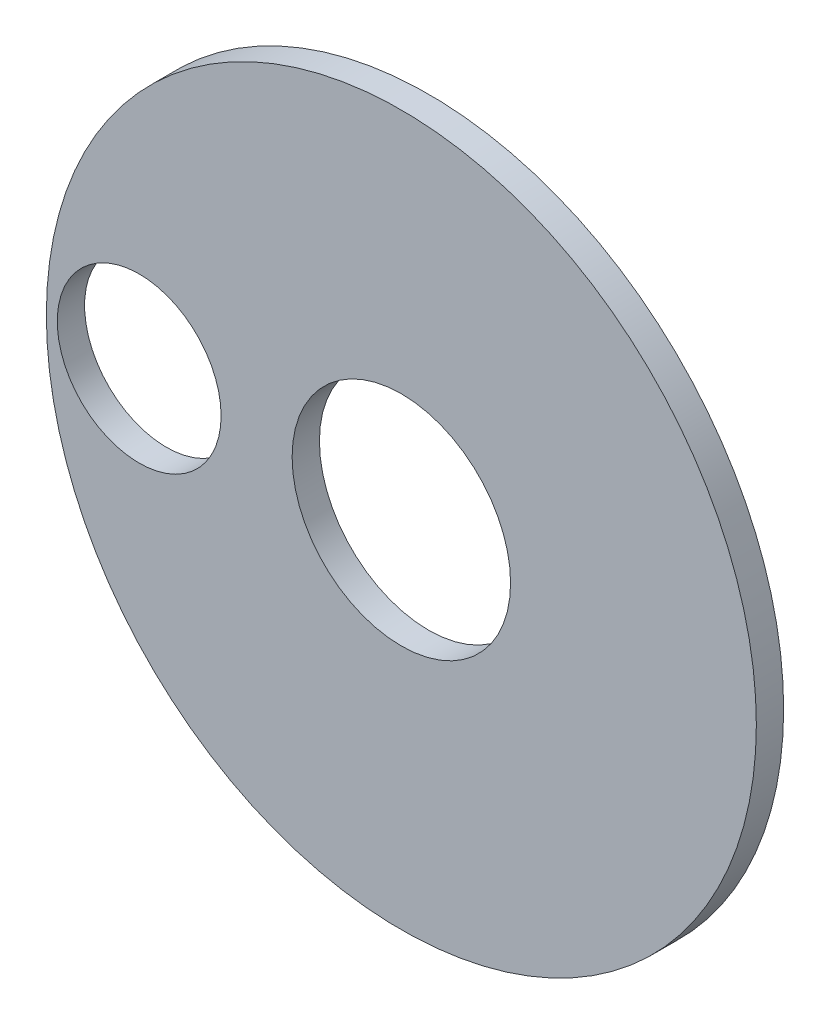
from build123d import *

# Parameters (mm, degrees)
SKETCH1_R      = 20.6375
SKETCH1_R_2    = 6.35
SKETCH1_R_3    = 4.7625
EXTRUDE1_DEPTH = 1.5875


with BuildPart() as part:
    # Sketch1 → Extrude1 (new body)
    with BuildSketch(Plane.XY):
        Circle(SKETCH1_R)
        Circle(SKETCH1_R_2, mode=Mode.SUBTRACT)
        with Locations((-15.24, 0)):
            Circle(SKETCH1_R_3, mode=Mode.SUBTRACT)
    extrude(amount=EXTRUDE1_DEPTH)


solid = part.part
